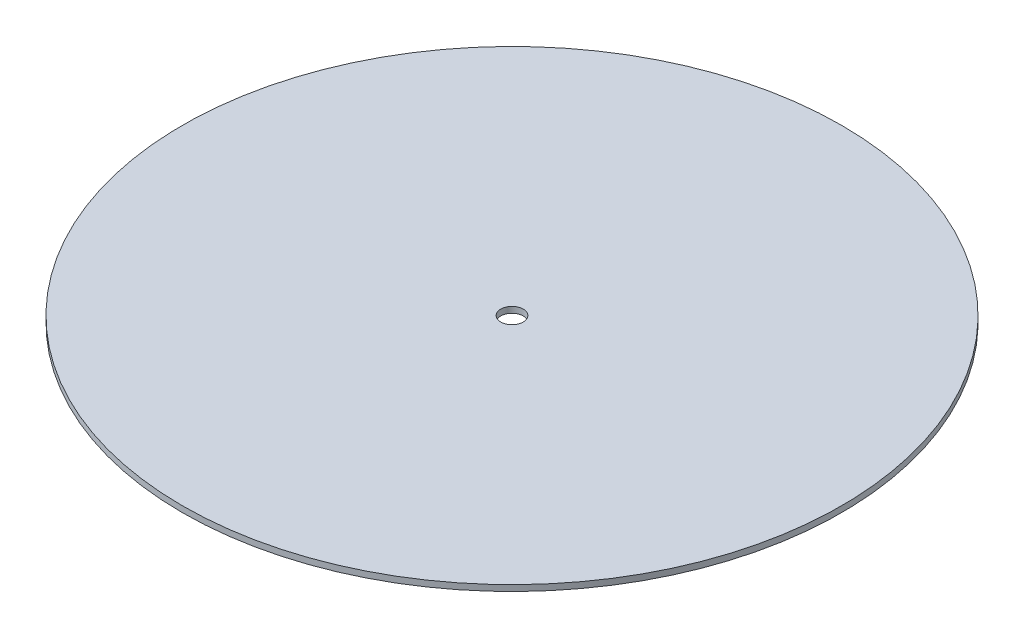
from build123d import *

# Parameters (mm, degrees)
SKETCH1_R           = 110
SKETCH1_R_2         = 3.75
BOSS_EXTRUDE1_DEPTH = 1


with BuildPart() as part:
    # Sketch1 → Boss-Extrude1 (new, symmetric)
    with BuildSketch(Plane(origin=(0, 0, 0), x_dir=(1, 0, 0), z_dir=(0, 1, 0))):
        with Locations(Location((0, 0, 0), (0, 0, 270))):
            Circle(SKETCH1_R)
        with Locations(Location((0, 0, 0), (0, 0, 270))):
            Circle(SKETCH1_R_2, mode=Mode.SUBTRACT)
    extrude(amount=BOSS_EXTRUDE1_DEPTH, both=True)


solid = part.part
